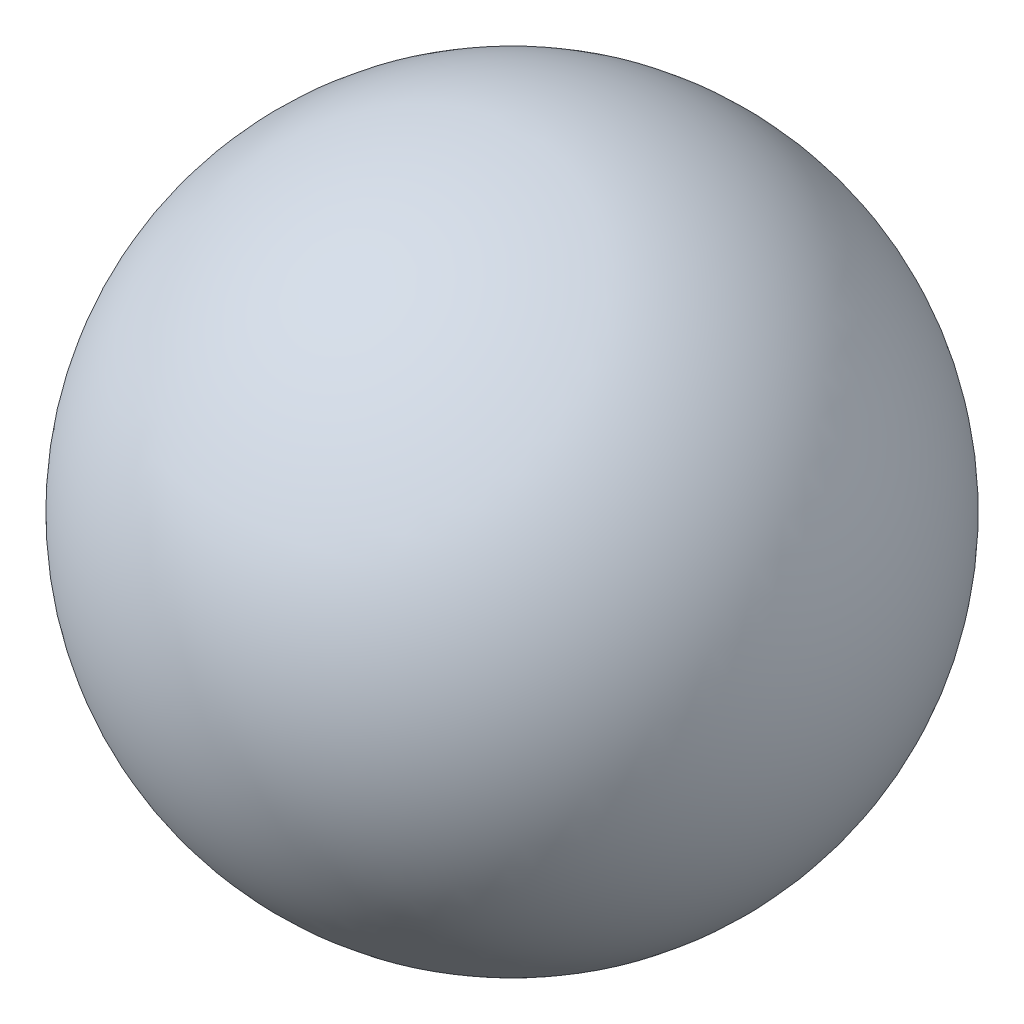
ISO-10303-21;
HEADER;
FILE_DESCRIPTION(('STEP AP214'),'2;1');
FILE_NAME('part.step','',(''),(''),'','','');
FILE_SCHEMA(('AUTOMOTIVE_DESIGN { 1 0 10303 214 1 1 1 1 }'));
ENDSEC;
DATA;
#1=APPLICATION_CONTEXT('core data for automotive mechanical design processes');
#2=APPLICATION_PROTOCOL_DEFINITION('international standard','automotive_design',2000,#1);
#3=PRODUCT_CONTEXT('',#1,'mechanical');
#4=PRODUCT('Part','Part','',(#3));
#5=PRODUCT_RELATED_PRODUCT_CATEGORY('part','',(#4));
#6=PRODUCT_DEFINITION_FORMATION('','',#4);
#7=PRODUCT_DEFINITION_CONTEXT('part definition',#1,'design');
#8=PRODUCT_DEFINITION('design','',#6,#7);
#9=PRODUCT_DEFINITION_SHAPE('','',#8);
#10=(LENGTH_UNIT() NAMED_UNIT(*) SI_UNIT(.MILLI.,.METRE.));
#11=(NAMED_UNIT(*) PLANE_ANGLE_UNIT() SI_UNIT($,.RADIAN.));
#12=(NAMED_UNIT(*) SI_UNIT($,.STERADIAN.) SOLID_ANGLE_UNIT());
#13=UNCERTAINTY_MEASURE_WITH_UNIT(LENGTH_MEASURE(1.E-05),#10,'distance_accuracy_value','');
#14=(GEOMETRIC_REPRESENTATION_CONTEXT(3) GLOBAL_UNCERTAINTY_ASSIGNED_CONTEXT((#13)) GLOBAL_UNIT_ASSIGNED_CONTEXT((#10,
#11,#12)) REPRESENTATION_CONTEXT('',''));
#15=CARTESIAN_POINT('',(0.,0.,0.));
#16=DIRECTION('',(0.,0.,1.));
#17=DIRECTION('',(1.,0.,0.));
#18=AXIS2_PLACEMENT_3D('',#15,#16,#17);
#19=CARTESIAN_POINT('',(0.,0.,0.));
#20=DIRECTION('',(0.,1.,0.));
#21=DIRECTION('',(1.,0.,0.));
#22=AXIS2_PLACEMENT_3D('',#19,#20,#21);
#23=SPHERICAL_SURFACE('',#22,1.190625);
#24=CARTESIAN_POINT('',(0.,1.190625,0.));
#25=VERTEX_POINT('',#24);
#26=VERTEX_LOOP('',#25);
#27=FACE_BOUND('',#26,.T.);
#28=ADVANCED_FACE('F30',(#27),#23,.T.);
#29=CLOSED_SHELL('',(#28));
#30=MANIFOLD_SOLID_BREP('B2',#29);
#31=ADVANCED_BREP_SHAPE_REPRESENTATION('',(#18,#30),#14);
#32=SHAPE_DEFINITION_REPRESENTATION(#9,#31);
ENDSEC;
END-ISO-10303-21;
